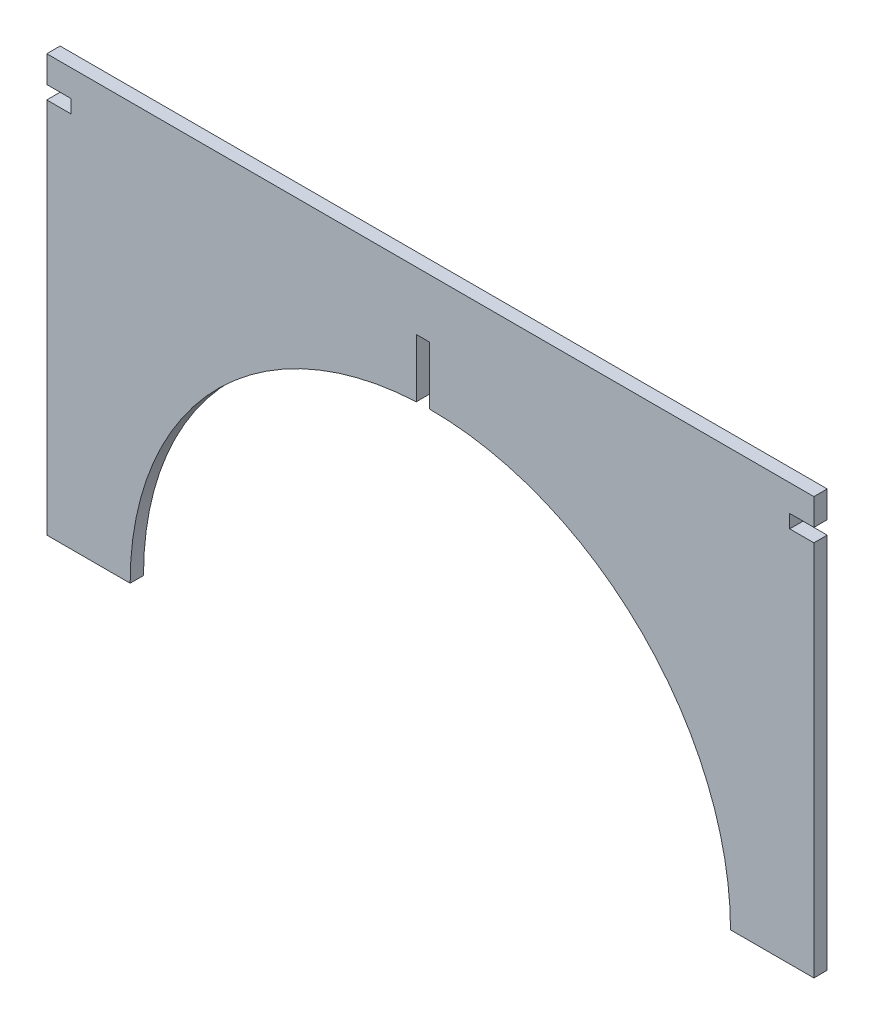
from build123d import *

# Parameters (mm, degrees)
BOSS_EXTRUDE1_DEPTH = 16
SKETCH5_W           = 29
SKETCH5_H           = 16
CUT_EXTRUDE3_DEPTH  = 16


with BuildPart() as part:
    # Sketch3 → Boss-Extrude1 (new body)
    with BuildSketch(Plane.XY):
        with BuildLine():
            Line((-672.642560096, 353.821839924), (247.357439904, 353.821839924))
            Line((247.357439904, 353.821839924), (247.357439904, -146.178160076))
            Line((247.357439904, -146.178160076), (147.357439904, -146.178160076))
            ThreePointArc((147.357439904, -146.178160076), (41.753196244, 108.937738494), (-213.497557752, 214.215611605))
            Line((-213.497557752, 214.215611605), (-213.497557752, 283.821839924))
            Line((-213.497557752, 283.821839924), (-229.497557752, 283.821839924))
            Line((-229.497557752, 283.821839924), (-229.497557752, 213.821839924))
            ThreePointArc((-229.497557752, 213.821839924), (-473.228289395, 102.601662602), (-572.642560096, -146.178160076))
            Line((-572.642560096, -146.178160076), (-672.642560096, -146.178160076))
            Line((-672.642560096, -146.178160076), (-672.642560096, 353.821839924))
        make_face()
    extrude(amount=BOSS_EXTRUDE1_DEPTH)

    # Sketch5 → Cut-Extrude3 (cut)
    with BuildSketch(Plane.XY.offset(16)):
        with Locations((232.857439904, 313.821839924)):
            Rectangle(SKETCH5_W, SKETCH5_H)
        with Locations((-658.142560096, 313.821839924)):
            Rectangle(SKETCH5_W, SKETCH5_H)
    extrude(amount=-CUT_EXTRUDE3_DEPTH, mode=Mode.SUBTRACT)


solid = part.part
